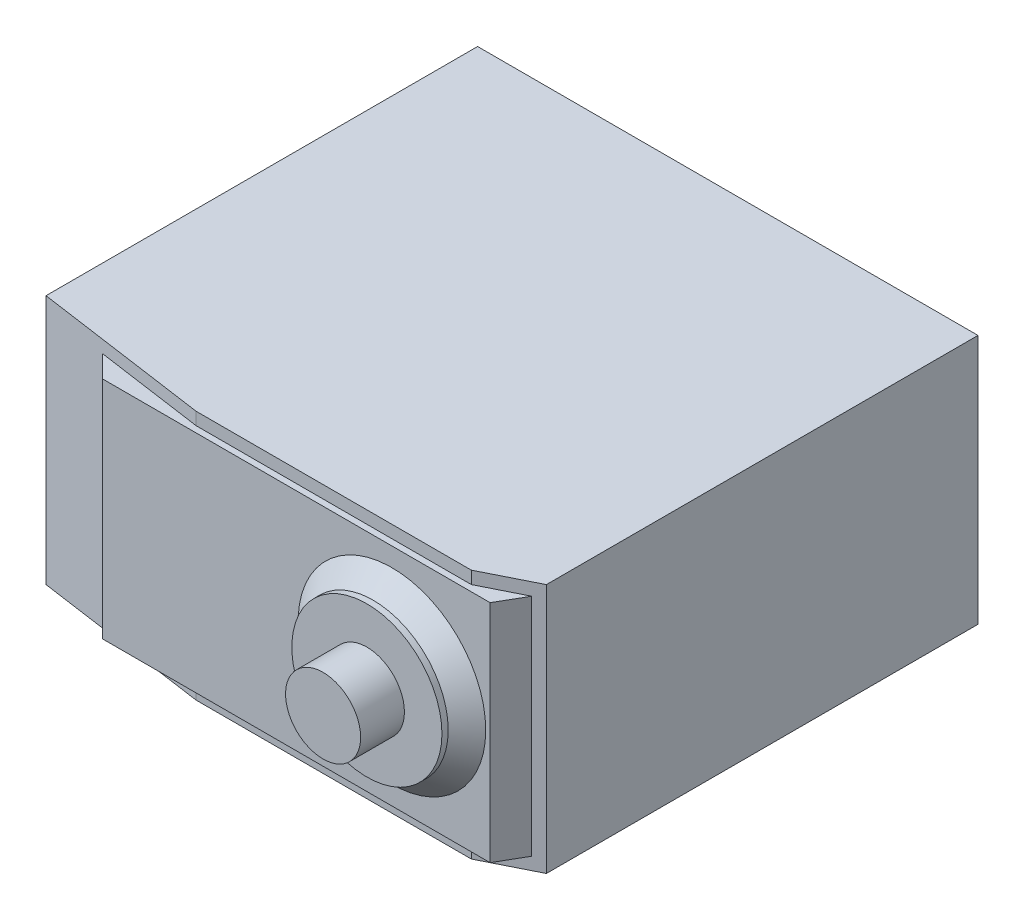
ISO-10303-21;
HEADER;
FILE_DESCRIPTION(('STEP AP214'),'2;1');
FILE_NAME('part.step','',(''),(''),'','','');
FILE_SCHEMA(('AUTOMOTIVE_DESIGN { 1 0 10303 214 1 1 1 1 }'));
ENDSEC;
DATA;
#1=APPLICATION_CONTEXT('core data for automotive mechanical design processes');
#2=APPLICATION_PROTOCOL_DEFINITION('international standard','automotive_design',2000,#1);
#3=PRODUCT_CONTEXT('',#1,'mechanical');
#4=PRODUCT('Part','Part','',(#3));
#5=PRODUCT_RELATED_PRODUCT_CATEGORY('part','',(#4));
#6=PRODUCT_DEFINITION_FORMATION('','',#4);
#7=PRODUCT_DEFINITION_CONTEXT('part definition',#1,'design');
#8=PRODUCT_DEFINITION('design','',#6,#7);
#9=PRODUCT_DEFINITION_SHAPE('','',#8);
#10=(LENGTH_UNIT() NAMED_UNIT(*) SI_UNIT(.MILLI.,.METRE.));
#11=(NAMED_UNIT(*) PLANE_ANGLE_UNIT() SI_UNIT($,.RADIAN.));
#12=(NAMED_UNIT(*) SI_UNIT($,.STERADIAN.) SOLID_ANGLE_UNIT());
#13=UNCERTAINTY_MEASURE_WITH_UNIT(LENGTH_MEASURE(1.E-05),#10,'distance_accuracy_value','');
#14=(GEOMETRIC_REPRESENTATION_CONTEXT(3) GLOBAL_UNCERTAINTY_ASSIGNED_CONTEXT((#13)) GLOBAL_UNIT_ASSIGNED_CONTEXT((#10,
#11,#12)) REPRESENTATION_CONTEXT('',''));
#15=CARTESIAN_POINT('',(0.,0.,0.));
#16=DIRECTION('',(0.,0.,1.));
#17=DIRECTION('',(1.,0.,0.));
#18=AXIS2_PLACEMENT_3D('',#15,#16,#17);
#19=CARTESIAN_POINT('',(10.15,0.,39.));
#20=DIRECTION('',(0.,0.,1.));
#21=DIRECTION('',(1.,0.,0.));
#22=AXIS2_PLACEMENT_3D('',#19,#20,#21);
#23=PLANE('',#22);
#24=CARTESIAN_POINT('',(10.15,0.,39.));
#25=DIRECTION('',(0.,0.,1.));
#26=DIRECTION('',(1.,0.,0.));
#27=AXIS2_PLACEMENT_3D('',#24,#25,#26);
#28=CIRCLE('',#27,6.);
#29=CARTESIAN_POINT('',(16.15,0.,39.));
#30=VERTEX_POINT('',#29);
#31=EDGE_CURVE('E134',#30,#30,#28,.T.);
#32=ORIENTED_EDGE('',*,*,#31,.T.);
#33=EDGE_LOOP('',(#32));
#34=FACE_BOUND('',#33,.T.);
#35=CARTESIAN_POINT('',(10.15,0.,39.));
#36=DIRECTION('',(0.,0.,1.));
#37=DIRECTION('',(1.,0.,0.));
#38=AXIS2_PLACEMENT_3D('',#35,#36,#37);
#39=CIRCLE('',#38,3.);
#40=CARTESIAN_POINT('',(13.15,0.,39.));
#41=VERTEX_POINT('',#40);
#42=EDGE_CURVE('E316',#41,#41,#39,.T.);
#43=ORIENTED_EDGE('',*,*,#42,.F.);
#44=EDGE_LOOP('',(#43));
#45=FACE_BOUND('',#44,.T.);
#46=ADVANCED_FACE('F33',(#34,#45),#23,.T.);
#47=CARTESIAN_POINT('',(0.,0.,37.));
#48=DIRECTION('',(0.,0.,1.));
#49=DIRECTION('',(1.,0.,0.));
#50=AXIS2_PLACEMENT_3D('',#47,#48,#49);
#51=PLANE('',#50);
#52=CARTESIAN_POINT('',(10.15,0.,37.));
#53=DIRECTION('',(0.,0.,1.));
#54=DIRECTION('',(1.,0.,0.));
#55=AXIS2_PLACEMENT_3D('',#52,#53,#54);
#56=CIRCLE('',#55,7.50000000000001);
#57=CARTESIAN_POINT('',(17.65,0.,37.));
#58=VERTEX_POINT('',#57);
#59=EDGE_CURVE('E11',#58,#58,#56,.F.);
#60=ORIENTED_EDGE('',*,*,#59,.T.);
#61=EDGE_LOOP('',(#60));
#62=FACE_BOUND('',#61,.T.);
#63=DIRECTION('',(0.,-1.,0.));
#64=VECTOR('',#63,1.);
#65=CARTESIAN_POINT('',(-13.,9.,37.));
#66=LINE('',#65,#64);
#67=CARTESIAN_POINT('',(-13.,9.,37.));
#68=VERTEX_POINT('',#67);
#69=CARTESIAN_POINT('',(-13.,-9.,37.));
#70=VERTEX_POINT('',#69);
#71=EDGE_CURVE('E146',#68,#70,#66,.T.);
#72=ORIENTED_EDGE('',*,*,#71,.T.);
#73=DIRECTION('',(1.,0.,0.));
#74=VECTOR('',#73,1.);
#75=CARTESIAN_POINT('',(-13.,-9.,37.));
#76=LINE('',#75,#74);
#77=CARTESIAN_POINT('',(18.,-9.,37.));
#78=VERTEX_POINT('',#77);
#79=EDGE_CURVE('E127',#70,#78,#76,.T.);
#80=ORIENTED_EDGE('',*,*,#79,.T.);
#81=DIRECTION('',(0.,1.,0.));
#82=VECTOR('',#81,1.);
#83=CARTESIAN_POINT('',(18.,9.,37.));
#84=LINE('',#83,#82);
#85=CARTESIAN_POINT('',(18.,9.,37.));
#86=VERTEX_POINT('',#85);
#87=EDGE_CURVE('E137',#78,#86,#84,.T.);
#88=ORIENTED_EDGE('',*,*,#87,.T.);
#89=DIRECTION('',(-1.,0.,0.));
#90=VECTOR('',#89,1.);
#91=CARTESIAN_POINT('',(-13.,9.,37.));
#92=LINE('',#91,#90);
#93=EDGE_CURVE('E143',#86,#68,#92,.T.);
#94=ORIENTED_EDGE('',*,*,#93,.T.);
#95=EDGE_LOOP('',(#72,#80,#88,#94));
#96=FACE_BOUND('',#95,.T.);
#97=ADVANCED_FACE('F145',(#62,#96),#51,.T.);
#98=CARTESIAN_POINT('',(20.,10.,34.5));
#99=DIRECTION('',(-0.447213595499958,0.,-0.894427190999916));
#100=DIRECTION('',(-0.894427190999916,0.,0.447213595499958));
#101=AXIS2_PLACEMENT_3D('',#98,#99,#100);
#102=PLANE('',#101);
#103=DIRECTION('',(0.894427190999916,0.,-0.447213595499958));
#104=VECTOR('',#103,1.);
#105=CARTESIAN_POINT('',(20.,9.,34.5));
#106=LINE('',#105,#104);
#107=CARTESIAN_POINT('',(16.,9.,36.5));
#108=VERTEX_POINT('',#107);
#109=CARTESIAN_POINT('',(19.2174822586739,9.,34.891258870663));
#110=VERTEX_POINT('',#109);
#111=EDGE_CURVE('E208',#108,#110,#106,.T.);
#112=ORIENTED_EDGE('',*,*,#111,.T.);
#113=DIRECTION('',(0.,-1.,0.));
#114=VECTOR('',#113,1.);
#115=CARTESIAN_POINT('',(19.2174822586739,10.,34.891258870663));
#116=LINE('',#115,#114);
#117=CARTESIAN_POINT('',(19.2174822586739,-9.,34.891258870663));
#118=VERTEX_POINT('',#117);
#119=EDGE_CURVE('E303',#110,#118,#116,.T.);
#120=ORIENTED_EDGE('',*,*,#119,.T.);
#121=DIRECTION('',(-0.894427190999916,0.,0.447213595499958));
#122=VECTOR('',#121,1.);
#123=CARTESIAN_POINT('',(20.,-9.,34.5));
#124=LINE('',#123,#122);
#125=CARTESIAN_POINT('',(16.,-9.,36.5));
#126=VERTEX_POINT('',#125);
#127=EDGE_CURVE('E129',#118,#126,#124,.T.);
#128=ORIENTED_EDGE('',*,*,#127,.T.);
#129=DIRECTION('',(0.,-1.,0.));
#130=VECTOR('',#129,1.);
#131=CARTESIAN_POINT('',(16.,10.,36.5));
#132=LINE('',#131,#130);
#133=CARTESIAN_POINT('',(16.,-10.,36.5));
#134=VERTEX_POINT('',#133);
#135=EDGE_CURVE('E168',#126,#134,#132,.T.);
#136=ORIENTED_EDGE('',*,*,#135,.T.);
#137=DIRECTION('',(0.894427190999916,0.,-0.447213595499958));
#138=VECTOR('',#137,1.);
#139=CARTESIAN_POINT('',(20.,-10.,34.5));
#140=LINE('',#139,#138);
#141=CARTESIAN_POINT('',(20.,-10.,34.5));
#142=VERTEX_POINT('',#141);
#143=EDGE_CURVE('E161',#134,#142,#140,.T.);
#144=ORIENTED_EDGE('',*,*,#143,.T.);
#145=DIRECTION('',(0.,-1.,0.));
#146=VECTOR('',#145,1.);
#147=CARTESIAN_POINT('',(20.,10.,34.5));
#148=LINE('',#147,#146);
#149=CARTESIAN_POINT('',(20.,10.,34.5));
#150=VERTEX_POINT('',#149);
#151=EDGE_CURVE('E163',#150,#142,#148,.T.);
#152=ORIENTED_EDGE('',*,*,#151,.F.);
#153=DIRECTION('',(0.894427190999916,0.,-0.447213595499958));
#154=VECTOR('',#153,1.);
#155=CARTESIAN_POINT('',(20.,10.,34.5));
#156=LINE('',#155,#154);
#157=CARTESIAN_POINT('',(16.,10.,36.5));
#158=VERTEX_POINT('',#157);
#159=EDGE_CURVE('E56',#158,#150,#156,.T.);
#160=ORIENTED_EDGE('',*,*,#159,.F.);
#161=EDGE_CURVE('E165',#158,#108,#132,.T.);
#162=ORIENTED_EDGE('',*,*,#161,.T.);
#163=EDGE_LOOP('',(#112,#120,#128,#136,#144,#152,#160,#162));
#164=FACE_BOUND('',#163,.T.);
#165=ADVANCED_FACE('F233',(#164),#102,.F.);
#166=CARTESIAN_POINT('',(0.,0.,36.5));
#167=DIRECTION('',(0.,0.,1.));
#168=DIRECTION('',(1.,0.,0.));
#169=AXIS2_PLACEMENT_3D('',#166,#167,#168);
#170=PLANE('',#169);
#171=DIRECTION('',(-1.,0.,0.));
#172=VECTOR('',#171,1.);
#173=CARTESIAN_POINT('',(0.,9.,36.5));
#174=LINE('',#173,#172);
#175=CARTESIAN_POINT('',(-6.,9.,36.5));
#176=VERTEX_POINT('',#175);
#177=EDGE_CURVE('E156',#108,#176,#174,.T.);
#178=ORIENTED_EDGE('',*,*,#177,.F.);
#179=ORIENTED_EDGE('',*,*,#161,.F.);
#180=DIRECTION('',(-1.,0.,0.));
#181=VECTOR('',#180,1.);
#182=CARTESIAN_POINT('',(20.,10.,36.5));
#183=LINE('',#182,#181);
#184=CARTESIAN_POINT('',(-6.,10.,36.5));
#185=VERTEX_POINT('',#184);
#186=EDGE_CURVE('E186',#158,#185,#183,.T.);
#187=ORIENTED_EDGE('',*,*,#186,.T.);
#188=DIRECTION('',(0.,-1.,0.));
#189=VECTOR('',#188,1.);
#190=CARTESIAN_POINT('',(-6.,10.,36.5));
#191=LINE('',#190,#189);
#192=EDGE_CURVE('E177',#185,#176,#191,.T.);
#193=ORIENTED_EDGE('',*,*,#192,.T.);
#194=EDGE_LOOP('',(#178,#179,#187,#193));
#195=FACE_BOUND('',#194,.T.);
#196=ADVANCED_FACE('F255',(#195),#170,.T.);
#197=CARTESIAN_POINT('',(-20.,-10.,36.5));
#198=DIRECTION('',(1.,0.,0.));
#199=DIRECTION('',(0.,0.,-1.));
#200=AXIS2_PLACEMENT_3D('',#197,#198,#199);
#201=PLANE('',#200);
#202=DIRECTION('',(0.,0.,-1.));
#203=VECTOR('',#202,1.);
#204=CARTESIAN_POINT('',(-20.,-10.,36.5));
#205=LINE('',#204,#203);
#206=CARTESIAN_POINT('',(-20.,-10.,34.5));
#207=VERTEX_POINT('',#206);
#208=CARTESIAN_POINT('',(-20.,-10.,0.));
#209=VERTEX_POINT('',#208);
#210=EDGE_CURVE('E205',#207,#209,#205,.T.);
#211=ORIENTED_EDGE('',*,*,#210,.F.);
#212=DIRECTION('',(0.,-1.,0.));
#213=VECTOR('',#212,1.);
#214=CARTESIAN_POINT('',(-20.,10.,34.5));
#215=LINE('',#214,#213);
#216=CARTESIAN_POINT('',(-20.,10.,34.5));
#217=VERTEX_POINT('',#216);
#218=EDGE_CURVE('E174',#217,#207,#215,.T.);
#219=ORIENTED_EDGE('',*,*,#218,.F.);
#220=DIRECTION('',(0.,0.,-1.));
#221=VECTOR('',#220,1.);
#222=CARTESIAN_POINT('',(-20.,10.,36.5));
#223=LINE('',#222,#221);
#224=CARTESIAN_POINT('',(-20.,10.,0.));
#225=VERTEX_POINT('',#224);
#226=EDGE_CURVE('E189',#217,#225,#223,.T.);
#227=ORIENTED_EDGE('',*,*,#226,.T.);
#228=DIRECTION('',(0.,-1.,0.));
#229=VECTOR('',#228,1.);
#230=CARTESIAN_POINT('',(-20.,-10.,0.));
#231=LINE('',#230,#229);
#232=EDGE_CURVE('E180',#225,#209,#231,.T.);
#233=ORIENTED_EDGE('',*,*,#232,.T.);
#234=EDGE_LOOP('',(#211,#219,#227,#233));
#235=FACE_BOUND('',#234,.T.);
#236=ADVANCED_FACE('F277',(#235),#201,.F.);
#237=CARTESIAN_POINT('',(20.,-10.,36.5));
#238=DIRECTION('',(0.,1.,0.));
#239=DIRECTION('',(-1.,0.,0.));
#240=AXIS2_PLACEMENT_3D('',#237,#238,#239);
#241=PLANE('',#240);
#242=DIRECTION('',(0.,0.,-1.));
#243=VECTOR('',#242,1.);
#244=CARTESIAN_POINT('',(20.,-10.,36.5));
#245=LINE('',#244,#243);
#246=CARTESIAN_POINT('',(20.,-10.,0.));
#247=VERTEX_POINT('',#246);
#248=EDGE_CURVE('E203',#142,#247,#245,.T.);
#249=ORIENTED_EDGE('',*,*,#248,.F.);
#250=ORIENTED_EDGE('',*,*,#143,.F.);
#251=DIRECTION('',(1.,0.,0.));
#252=VECTOR('',#251,1.);
#253=CARTESIAN_POINT('',(20.,-10.,36.5));
#254=LINE('',#253,#252);
#255=CARTESIAN_POINT('',(-5.99999999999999,-10.,36.5));
#256=VERTEX_POINT('',#255);
#257=EDGE_CURVE('E183',#256,#134,#254,.T.);
#258=ORIENTED_EDGE('',*,*,#257,.F.);
#259=DIRECTION('',(0.989949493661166,0.,0.14142135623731));
#260=VECTOR('',#259,1.);
#261=CARTESIAN_POINT('',(-6.,-10.,36.5));
#262=LINE('',#261,#260);
#263=EDGE_CURVE('E167',#207,#256,#262,.T.);
#264=ORIENTED_EDGE('',*,*,#263,.F.);
#265=ORIENTED_EDGE('',*,*,#210,.T.);
#266=DIRECTION('',(1.,0.,0.));
#267=VECTOR('',#266,1.);
#268=CARTESIAN_POINT('',(20.,-10.,0.));
#269=LINE('',#268,#267);
#270=EDGE_CURVE('E192',#209,#247,#269,.T.);
#271=ORIENTED_EDGE('',*,*,#270,.T.);
#272=EDGE_LOOP('',(#249,#250,#258,#264,#265,#271));
#273=FACE_BOUND('',#272,.T.);
#274=ADVANCED_FACE('F274',(#273),#241,.F.);
#275=CARTESIAN_POINT('',(20.,-10.,36.5));
#276=DIRECTION('',(-1.,0.,0.));
#277=DIRECTION('',(0.,0.,1.));
#278=AXIS2_PLACEMENT_3D('',#275,#276,#277);
#279=PLANE('',#278);
#280=DIRECTION('',(0.,0.,-1.));
#281=VECTOR('',#280,1.);
#282=CARTESIAN_POINT('',(20.,10.,36.5));
#283=LINE('',#282,#281);
#284=CARTESIAN_POINT('',(20.,10.,0.));
#285=VERTEX_POINT('',#284);
#286=EDGE_CURVE('E201',#150,#285,#283,.T.);
#287=ORIENTED_EDGE('',*,*,#286,.F.);
#288=ORIENTED_EDGE('',*,*,#151,.T.);
#289=ORIENTED_EDGE('',*,*,#248,.T.);
#290=DIRECTION('',(0.,1.,0.));
#291=VECTOR('',#290,1.);
#292=CARTESIAN_POINT('',(20.,-10.,0.));
#293=LINE('',#292,#291);
#294=EDGE_CURVE('E195',#247,#285,#293,.T.);
#295=ORIENTED_EDGE('',*,*,#294,.T.);
#296=EDGE_LOOP('',(#287,#288,#289,#295));
#297=FACE_BOUND('',#296,.T.);
#298=ADVANCED_FACE('F270',(#297),#279,.F.);
#299=CARTESIAN_POINT('',(20.,10.,36.5));
#300=DIRECTION('',(0.,-1.,0.));
#301=DIRECTION('',(1.,0.,0.));
#302=AXIS2_PLACEMENT_3D('',#299,#300,#301);
#303=PLANE('',#302);
#304=ORIENTED_EDGE('',*,*,#186,.F.);
#305=ORIENTED_EDGE('',*,*,#159,.T.);
#306=ORIENTED_EDGE('',*,*,#286,.T.);
#307=DIRECTION('',(-1.,0.,0.));
#308=VECTOR('',#307,1.);
#309=CARTESIAN_POINT('',(20.,10.,0.));
#310=LINE('',#309,#308);
#311=EDGE_CURVE('E187',#285,#225,#310,.T.);
#312=ORIENTED_EDGE('',*,*,#311,.T.);
#313=ORIENTED_EDGE('',*,*,#226,.F.);
#314=DIRECTION('',(0.989949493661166,0.,0.14142135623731));
#315=VECTOR('',#314,1.);
#316=CARTESIAN_POINT('',(-6.,10.,36.5));
#317=LINE('',#316,#315);
#318=EDGE_CURVE('E171',#217,#185,#317,.T.);
#319=ORIENTED_EDGE('',*,*,#318,.T.);
#320=EDGE_LOOP('',(#304,#305,#306,#312,#313,#319));
#321=FACE_BOUND('',#320,.T.);
#322=ADVANCED_FACE('F263',(#321),#303,.F.);
#323=DIRECTION('',(1.,0.,0.));
#324=VECTOR('',#323,1.);
#325=CARTESIAN_POINT('',(0.,-9.,36.5));
#326=LINE('',#325,#324);
#327=CARTESIAN_POINT('',(-6.,-9.,36.5));
#328=VERTEX_POINT('',#327);
#329=EDGE_CURVE('E48',#328,#126,#326,.T.);
#330=ORIENTED_EDGE('',*,*,#329,.F.);
#331=EDGE_CURVE('E181',#328,#256,#191,.T.);
#332=ORIENTED_EDGE('',*,*,#331,.T.);
#333=ORIENTED_EDGE('',*,*,#257,.T.);
#334=ORIENTED_EDGE('',*,*,#135,.F.);
#335=EDGE_LOOP('',(#330,#332,#333,#334));
#336=FACE_BOUND('',#335,.T.);
#337=ADVANCED_FACE('F260',(#336),#170,.T.);
#338=CARTESIAN_POINT('',(0.,0.,0.));
#339=DIRECTION('',(0.,0.,1.));
#340=DIRECTION('',(1.,0.,0.));
#341=AXIS2_PLACEMENT_3D('',#338,#339,#340);
#342=PLANE('',#341);
#343=ORIENTED_EDGE('',*,*,#232,.F.);
#344=ORIENTED_EDGE('',*,*,#311,.F.);
#345=ORIENTED_EDGE('',*,*,#294,.F.);
#346=ORIENTED_EDGE('',*,*,#270,.F.);
#347=EDGE_LOOP('',(#343,#344,#345,#346));
#348=FACE_BOUND('',#347,.T.);
#349=ADVANCED_FACE('F258',(#348),#342,.F.);
#350=CARTESIAN_POINT('',(-6.,10.,36.5));
#351=DIRECTION('',(0.14142135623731,0.,-0.989949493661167));
#352=DIRECTION('',(-0.989949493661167,0.,-0.14142135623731));
#353=AXIS2_PLACEMENT_3D('',#350,#351,#352);
#354=PLANE('',#353);
#355=DIRECTION('',(0.,1.,0.));
#356=VECTOR('',#355,1.);
#357=CARTESIAN_POINT('',(-14.75,10.,35.25));
#358=LINE('',#357,#356);
#359=CARTESIAN_POINT('',(-14.75,-9.,35.25));
#360=VERTEX_POINT('',#359);
#361=CARTESIAN_POINT('',(-14.75,9.,35.25));
#362=VERTEX_POINT('',#361);
#363=EDGE_CURVE('E148',#360,#362,#358,.T.);
#364=ORIENTED_EDGE('',*,*,#363,.T.);
#365=DIRECTION('',(0.989949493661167,0.,0.14142135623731));
#366=VECTOR('',#365,1.);
#367=CARTESIAN_POINT('',(-6.,9.,36.5));
#368=LINE('',#367,#366);
#369=EDGE_CURVE('E158',#362,#176,#368,.T.);
#370=ORIENTED_EDGE('',*,*,#369,.T.);
#371=ORIENTED_EDGE('',*,*,#192,.F.);
#372=ORIENTED_EDGE('',*,*,#318,.F.);
#373=ORIENTED_EDGE('',*,*,#218,.T.);
#374=ORIENTED_EDGE('',*,*,#263,.T.);
#375=ORIENTED_EDGE('',*,*,#331,.F.);
#376=DIRECTION('',(-0.989949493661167,0.,-0.14142135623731));
#377=VECTOR('',#376,1.);
#378=CARTESIAN_POINT('',(-6.,-9.,36.5));
#379=LINE('',#378,#377);
#380=EDGE_CURVE('E154',#328,#360,#379,.T.);
#381=ORIENTED_EDGE('',*,*,#380,.T.);
#382=EDGE_LOOP('',(#364,#370,#371,#372,#373,#374,#375,#381));
#383=FACE_BOUND('',#382,.T.);
#384=ADVANCED_FACE('F249',(#383),#354,.F.);
#385=CARTESIAN_POINT('',(-13.,9.,32.));
#386=DIRECTION('',(0.,1.,0.));
#387=DIRECTION('',(-1.,0.,0.));
#388=AXIS2_PLACEMENT_3D('',#385,#386,#387);
#389=PLANE('',#388);
#390=ORIENTED_EDGE('',*,*,#369,.F.);
#391=DIRECTION('',(-0.707106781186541,0.,-0.707106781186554));
#392=VECTOR('',#391,1.);
#393=CARTESIAN_POINT('',(-13.,9.,37.));
#394=LINE('',#393,#392);
#395=EDGE_CURVE('E311',#68,#362,#394,.T.);
#396=ORIENTED_EDGE('',*,*,#395,.F.);
#397=ORIENTED_EDGE('',*,*,#93,.F.);
#398=DIRECTION('',(-0.499999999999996,0.,0.866025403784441));
#399=VECTOR('',#398,1.);
#400=CARTESIAN_POINT('',(18.,9.,37.));
#401=LINE('',#400,#399);
#402=EDGE_CURVE('E133',#110,#86,#401,.T.);
#403=ORIENTED_EDGE('',*,*,#402,.F.);
#404=ORIENTED_EDGE('',*,*,#111,.F.);
#405=ORIENTED_EDGE('',*,*,#177,.T.);
#406=EDGE_LOOP('',(#390,#396,#397,#403,#404,#405));
#407=FACE_BOUND('',#406,.T.);
#408=ADVANCED_FACE('F246',(#407),#389,.T.);
#409=CARTESIAN_POINT('',(-13.,-9.,32.));
#410=DIRECTION('',(0.,-1.,0.));
#411=DIRECTION('',(0.,0.,-1.));
#412=AXIS2_PLACEMENT_3D('',#409,#410,#411);
#413=PLANE('',#412);
#414=ORIENTED_EDGE('',*,*,#380,.F.);
#415=ORIENTED_EDGE('',*,*,#329,.T.);
#416=ORIENTED_EDGE('',*,*,#127,.F.);
#417=DIRECTION('',(-0.499999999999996,0.,0.866025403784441));
#418=VECTOR('',#417,1.);
#419=CARTESIAN_POINT('',(18.,-9.,37.));
#420=LINE('',#419,#418);
#421=EDGE_CURVE('E122',#118,#78,#420,.T.);
#422=ORIENTED_EDGE('',*,*,#421,.T.);
#423=ORIENTED_EDGE('',*,*,#79,.F.);
#424=DIRECTION('',(-0.707106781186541,0.,-0.707106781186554));
#425=VECTOR('',#424,1.);
#426=CARTESIAN_POINT('',(-13.,-9.,37.));
#427=LINE('',#426,#425);
#428=EDGE_CURVE('E304',#70,#360,#427,.T.);
#429=ORIENTED_EDGE('',*,*,#428,.T.);
#430=EDGE_LOOP('',(#414,#415,#416,#422,#423,#429));
#431=FACE_BOUND('',#430,.T.);
#432=ADVANCED_FACE('F124',(#431),#413,.T.);
#433=CARTESIAN_POINT('',(-13.,9.,37.));
#434=DIRECTION('',(-0.707106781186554,0.,0.707106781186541));
#435=DIRECTION('',(0.707106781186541,0.,0.707106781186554));
#436=AXIS2_PLACEMENT_3D('',#433,#434,#435);
#437=PLANE('',#436);
#438=ORIENTED_EDGE('',*,*,#363,.F.);
#439=ORIENTED_EDGE('',*,*,#428,.F.);
#440=ORIENTED_EDGE('',*,*,#71,.F.);
#441=ORIENTED_EDGE('',*,*,#395,.T.);
#442=EDGE_LOOP('',(#438,#439,#440,#441));
#443=FACE_BOUND('',#442,.T.);
#444=ADVANCED_FACE('F242',(#443),#437,.T.);
#445=CARTESIAN_POINT('',(18.,9.,37.));
#446=DIRECTION('',(0.866025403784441,0.,0.499999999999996));
#447=DIRECTION('',(0.499999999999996,0.,-0.866025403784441));
#448=AXIS2_PLACEMENT_3D('',#445,#446,#447);
#449=PLANE('',#448);
#450=ORIENTED_EDGE('',*,*,#119,.F.);
#451=ORIENTED_EDGE('',*,*,#402,.T.);
#452=ORIENTED_EDGE('',*,*,#87,.F.);
#453=ORIENTED_EDGE('',*,*,#421,.F.);
#454=EDGE_LOOP('',(#450,#451,#452,#453));
#455=FACE_BOUND('',#454,.T.);
#456=ADVANCED_FACE('F138',(#455),#449,.T.);
#457=CARTESIAN_POINT('',(10.15,0.,39.));
#458=DIRECTION('',(0.,0.,-1.));
#459=DIRECTION('',(-1.,0.,0.));
#460=AXIS2_PLACEMENT_3D('',#457,#458,#459);
#461=CYLINDRICAL_SURFACE('',#460,6.);
#462=CARTESIAN_POINT('',(10.15,0.,38.5));
#463=DIRECTION('',(0.,0.,1.));
#464=DIRECTION('',(1.,0.,0.));
#465=AXIS2_PLACEMENT_3D('',#462,#463,#464);
#466=CIRCLE('',#465,6.);
#467=CARTESIAN_POINT('',(16.15,0.,38.5));
#468=VERTEX_POINT('',#467);
#469=EDGE_CURVE('E41',#468,#468,#466,.T.);
#470=ORIENTED_EDGE('',*,*,#469,.T.);
#471=EDGE_LOOP('',(#470));
#472=FACE_BOUND('',#471,.T.);
#473=ORIENTED_EDGE('',*,*,#31,.F.);
#474=EDGE_LOOP('',(#473));
#475=FACE_BOUND('',#474,.T.);
#476=ADVANCED_FACE('F212',(#472,#475),#461,.T.);
#477=CARTESIAN_POINT('',(10.15,0.,38.5));
#478=DIRECTION('',(0.,0.,-1.));
#479=DIRECTION('',(-1.,0.,0.));
#480=AXIS2_PLACEMENT_3D('',#477,#478,#479);
#481=CONICAL_SURFACE('',#480,6.,0.785398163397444);
#482=ORIENTED_EDGE('',*,*,#59,.F.);
#483=EDGE_LOOP('',(#482));
#484=FACE_BOUND('',#483,.T.);
#485=ORIENTED_EDGE('',*,*,#469,.F.);
#486=EDGE_LOOP('',(#485));
#487=FACE_BOUND('',#486,.T.);
#488=ADVANCED_FACE('F35',(#484,#487),#481,.T.);
#489=CARTESIAN_POINT('',(10.15,0.,42.5));
#490=DIRECTION('',(0.,0.,-1.));
#491=DIRECTION('',(-1.,0.,0.));
#492=AXIS2_PLACEMENT_3D('',#489,#490,#491);
#493=CYLINDRICAL_SURFACE('',#492,3.);
#494=CARTESIAN_POINT('',(10.15,0.,42.5));
#495=DIRECTION('',(0.,0.,1.));
#496=DIRECTION('',(1.,0.,0.));
#497=AXIS2_PLACEMENT_3D('',#494,#495,#496);
#498=CIRCLE('',#497,3.);
#499=CARTESIAN_POINT('',(13.15,0.,42.5));
#500=VERTEX_POINT('',#499);
#501=EDGE_CURVE('E315',#500,#500,#498,.T.);
#502=ORIENTED_EDGE('',*,*,#501,.F.);
#503=EDGE_LOOP('',(#502));
#504=FACE_BOUND('',#503,.T.);
#505=ORIENTED_EDGE('',*,*,#42,.T.);
#506=EDGE_LOOP('',(#505));
#507=FACE_BOUND('',#506,.T.);
#508=ADVANCED_FACE('F216',(#504,#507),#493,.T.);
#509=CARTESIAN_POINT('',(10.15,0.,42.5));
#510=DIRECTION('',(0.,0.,1.));
#511=DIRECTION('',(1.,0.,0.));
#512=AXIS2_PLACEMENT_3D('',#509,#510,#511);
#513=PLANE('',#512);
#514=ORIENTED_EDGE('',*,*,#501,.T.);
#515=EDGE_LOOP('',(#514));
#516=FACE_BOUND('',#515,.T.);
#517=ADVANCED_FACE('F222',(#516),#513,.T.);
#518=CLOSED_SHELL('',(#46,#97,#165,#196,#236,#274,#298,#322,#337,#349,#384,#408,#432,#444,#456,
#476,#488,#508,#517));
#519=MANIFOLD_SOLID_BREP('B2',#518);
#520=ADVANCED_BREP_SHAPE_REPRESENTATION('',(#18,#519),#14);
#521=SHAPE_DEFINITION_REPRESENTATION(#9,#520);
ENDSEC;
END-ISO-10303-21;
